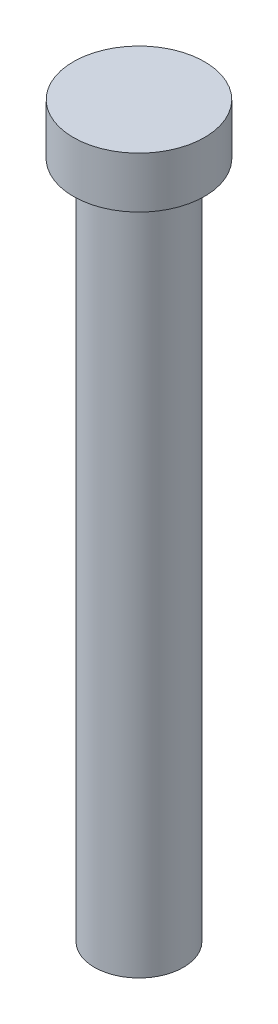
from build123d import *

# Parameters (mm, degrees)
PINDIA_R            = 6.1
LENGTH_DEPTH        = 100
HEADDIA_R           = 9
HEADTHICKNESS_DEPTH = 7
FILLET1_R           = 0.8


with BuildPart() as part:
    # PinDia → Length (new body)
    with BuildSketch(Plane(origin=(0, 0, 0), x_dir=(1, 0, 0), z_dir=(0, 1, 0))):
        with Locations(Location((0, 0, 0), (0, 0, 270))):
            Circle(PINDIA_R)
    extrude(amount=-LENGTH_DEPTH)

    # HeadDia → HeadThickness (add)
    with BuildSketch(Plane(origin=(0, 0, 0), x_dir=(1, 0, 0), z_dir=(0, 1, 0))):
        with Locations(Location((0, 0, 0), (0, 0, 270))):
            Circle(HEADDIA_R)
    extrude(amount=-HEADTHICKNESS_DEPTH)

    # Fillet1
    fillet1_edges = [part.edges().sort_by_distance(p)[0] for p in [
        (0, -7, -6.1),
    ]]
    fillet(fillet1_edges, radius=FILLET1_R)


solid = part.part
